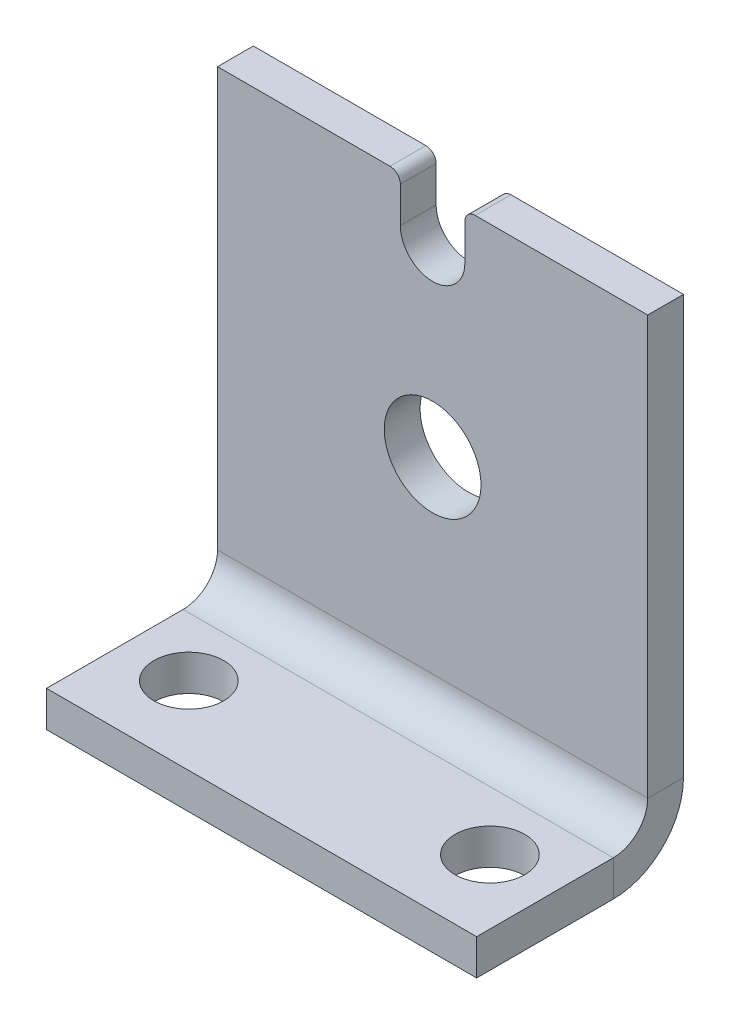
ISO-10303-21;
HEADER;
FILE_DESCRIPTION(('STEP AP214'),'2;1');
FILE_NAME('part.step','',(''),(''),'','','');
FILE_SCHEMA(('AUTOMOTIVE_DESIGN { 1 0 10303 214 1 1 1 1 }'));
ENDSEC;
DATA;
#1=APPLICATION_CONTEXT('core data for automotive mechanical design processes');
#2=APPLICATION_PROTOCOL_DEFINITION('international standard','automotive_design',2000,#1);
#3=PRODUCT_CONTEXT('',#1,'mechanical');
#4=PRODUCT('Part','Part','',(#3));
#5=PRODUCT_RELATED_PRODUCT_CATEGORY('part','',(#4));
#6=PRODUCT_DEFINITION_FORMATION('','',#4);
#7=PRODUCT_DEFINITION_CONTEXT('part definition',#1,'design');
#8=PRODUCT_DEFINITION('design','',#6,#7);
#9=PRODUCT_DEFINITION_SHAPE('','',#8);
#10=(LENGTH_UNIT() NAMED_UNIT(*) SI_UNIT(.MILLI.,.METRE.));
#11=(NAMED_UNIT(*) PLANE_ANGLE_UNIT() SI_UNIT($,.RADIAN.));
#12=(NAMED_UNIT(*) SI_UNIT($,.STERADIAN.) SOLID_ANGLE_UNIT());
#13=UNCERTAINTY_MEASURE_WITH_UNIT(LENGTH_MEASURE(1.E-05),#10,'distance_accuracy_value','');
#14=(GEOMETRIC_REPRESENTATION_CONTEXT(3) GLOBAL_UNCERTAINTY_ASSIGNED_CONTEXT((#13)) GLOBAL_UNIT_ASSIGNED_CONTEXT((#10,
#11,#12)) REPRESENTATION_CONTEXT('',''));
#15=CARTESIAN_POINT('',(0.,0.,0.));
#16=DIRECTION('',(0.,0.,1.));
#17=DIRECTION('',(1.,0.,0.));
#18=AXIS2_PLACEMENT_3D('',#15,#16,#17);
#19=CARTESIAN_POINT('',(-15.875,18.034,-2.6416));
#20=DIRECTION('',(0.,1.,0.));
#21=DIRECTION('',(0.,0.,1.));
#22=AXIS2_PLACEMENT_3D('',#19,#20,#21);
#23=PLANE('',#22);
#24=DIRECTION('',(-1.,0.,0.));
#25=VECTOR('',#24,1.);
#26=CARTESIAN_POINT('',(-15.875,18.034,0.));
#27=LINE('',#26,#25);
#28=CARTESIAN_POINT('',(-3.14325,18.034,0.));
#29=VERTEX_POINT('',#28);
#30=CARTESIAN_POINT('',(-15.875,18.034,0.));
#31=VERTEX_POINT('',#30);
#32=EDGE_CURVE('E273',#29,#31,#27,.T.);
#33=ORIENTED_EDGE('',*,*,#32,.F.);
#34=DIRECTION('',(0.,0.,1.));
#35=VECTOR('',#34,1.);
#36=CARTESIAN_POINT('',(-3.14325,18.034,-2.6416));
#37=LINE('',#36,#35);
#38=CARTESIAN_POINT('',(-3.14325,18.034,-2.6416));
#39=VERTEX_POINT('',#38);
#40=EDGE_CURVE('E289',#29,#39,#37,.F.);
#41=ORIENTED_EDGE('',*,*,#40,.T.);
#42=DIRECTION('',(-1.,0.,0.));
#43=VECTOR('',#42,1.);
#44=CARTESIAN_POINT('',(-15.875,18.034,-2.6416));
#45=LINE('',#44,#43);
#46=CARTESIAN_POINT('',(-15.875,18.034,-2.6416));
#47=VERTEX_POINT('',#46);
#48=EDGE_CURVE('E264',#39,#47,#45,.T.);
#49=ORIENTED_EDGE('',*,*,#48,.T.);
#50=DIRECTION('',(0.,0.,1.));
#51=VECTOR('',#50,1.);
#52=CARTESIAN_POINT('',(-15.875,18.034,-2.6416));
#53=LINE('',#52,#51);
#54=EDGE_CURVE('E278',#47,#31,#53,.T.);
#55=ORIENTED_EDGE('',*,*,#54,.T.);
#56=EDGE_LOOP('',(#33,#41,#49,#55));
#57=FACE_BOUND('',#56,.T.);
#58=ADVANCED_FACE('F56',(#57),#23,.T.);
#59=CARTESIAN_POINT('',(15.875,-18.034,-2.6416));
#60=DIRECTION('',(1.,0.,0.));
#61=DIRECTION('',(0.,0.,-1.));
#62=AXIS2_PLACEMENT_3D('',#59,#60,#61);
#63=PLANE('',#62);
#64=DIRECTION('',(0.,1.,0.));
#65=VECTOR('',#64,1.);
#66=CARTESIAN_POINT('',(15.875,-18.034,0.));
#67=LINE('',#66,#65);
#68=CARTESIAN_POINT('',(15.875,-12.8524,0.));
#69=VERTEX_POINT('',#68);
#70=CARTESIAN_POINT('',(15.875,18.034,0.));
#71=VERTEX_POINT('',#70);
#72=EDGE_CURVE('E259',#69,#71,#67,.T.);
#73=ORIENTED_EDGE('',*,*,#72,.F.);
#74=DIRECTION('',(0.,0.,-1.));
#75=VECTOR('',#74,1.);
#76=CARTESIAN_POINT('',(15.875,-12.8524,0.));
#77=LINE('',#76,#75);
#78=CARTESIAN_POINT('',(15.875,-12.8524,-2.6416));
#79=VERTEX_POINT('',#78);
#80=EDGE_CURVE('E246',#69,#79,#77,.T.);
#81=ORIENTED_EDGE('',*,*,#80,.T.);
#82=DIRECTION('',(0.,1.,0.));
#83=VECTOR('',#82,1.);
#84=CARTESIAN_POINT('',(15.875,-18.034,-2.6416));
#85=LINE('',#84,#83);
#86=CARTESIAN_POINT('',(15.875,18.034,-2.6416));
#87=VERTEX_POINT('',#86);
#88=EDGE_CURVE('E262',#79,#87,#85,.T.);
#89=ORIENTED_EDGE('',*,*,#88,.T.);
#90=DIRECTION('',(0.,0.,1.));
#91=VECTOR('',#90,1.);
#92=CARTESIAN_POINT('',(15.875,18.034,-2.6416));
#93=LINE('',#92,#91);
#94=EDGE_CURVE('E271',#87,#71,#93,.T.);
#95=ORIENTED_EDGE('',*,*,#94,.T.);
#96=EDGE_LOOP('',(#73,#81,#89,#95));
#97=FACE_BOUND('',#96,.T.);
#98=ADVANCED_FACE('F317',(#97),#63,.T.);
#99=CARTESIAN_POINT('',(0.,0.,-2.6416));
#100=DIRECTION('',(0.,0.,-1.));
#101=DIRECTION('',(-1.,0.,0.));
#102=AXIS2_PLACEMENT_3D('',#99,#100,#101);
#103=PLANE('',#102);
#104=ORIENTED_EDGE('',*,*,#48,.F.);
#105=CARTESIAN_POINT('',(-3.14325,17.272,-2.6416));
#106=DIRECTION('',(0.,0.,-1.));
#107=DIRECTION('',(-1.,0.,0.));
#108=AXIS2_PLACEMENT_3D('',#105,#106,#107);
#109=CIRCLE('',#108,0.762);
#110=CARTESIAN_POINT('',(-2.38125,17.272,-2.6416));
#111=VERTEX_POINT('',#110);
#112=EDGE_CURVE('E292',#39,#111,#109,.T.);
#113=ORIENTED_EDGE('',*,*,#112,.T.);
#114=DIRECTION('',(0.,1.,0.));
#115=VECTOR('',#114,1.);
#116=CARTESIAN_POINT('',(-2.38125,20.4917479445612,-2.6416));
#117=LINE('',#116,#115);
#118=CARTESIAN_POINT('',(-2.38125,14.62405,-2.6416));
#119=VERTEX_POINT('',#118);
#120=EDGE_CURVE('E167',#119,#111,#117,.T.);
#121=ORIENTED_EDGE('',*,*,#120,.F.);
#122=CARTESIAN_POINT('',(0.,14.62405,-2.6416));
#123=DIRECTION('',(0.,0.,-1.));
#124=DIRECTION('',(-1.,0.,0.));
#125=AXIS2_PLACEMENT_3D('',#122,#123,#124);
#126=CIRCLE('',#125,2.38125);
#127=CARTESIAN_POINT('',(2.38125,14.62405,-2.6416));
#128=VERTEX_POINT('',#127);
#129=EDGE_CURVE('E185',#128,#119,#126,.T.);
#130=ORIENTED_EDGE('',*,*,#129,.F.);
#131=DIRECTION('',(0.,-1.,0.));
#132=VECTOR('',#131,1.);
#133=CARTESIAN_POINT('',(2.38125,20.4917479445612,-2.6416));
#134=LINE('',#133,#132);
#135=CARTESIAN_POINT('',(2.38125,17.272,-2.6416));
#136=VERTEX_POINT('',#135);
#137=EDGE_CURVE('E172',#136,#128,#134,.T.);
#138=ORIENTED_EDGE('',*,*,#137,.F.);
#139=CARTESIAN_POINT('',(3.14325,17.272,-2.6416));
#140=DIRECTION('',(0.,0.,-1.));
#141=DIRECTION('',(-1.,0.,0.));
#142=AXIS2_PLACEMENT_3D('',#139,#140,#141);
#143=CIRCLE('',#142,0.762);
#144=CARTESIAN_POINT('',(3.14325,18.034,-2.6416));
#145=VERTEX_POINT('',#144);
#146=EDGE_CURVE('E71',#136,#145,#143,.T.);
#147=ORIENTED_EDGE('',*,*,#146,.T.);
#148=EDGE_CURVE('E266',#87,#145,#45,.T.);
#149=ORIENTED_EDGE('',*,*,#148,.F.);
#150=ORIENTED_EDGE('',*,*,#88,.F.);
#151=DIRECTION('',(1.,0.,0.));
#152=VECTOR('',#151,1.);
#153=CARTESIAN_POINT('',(15.875,-12.8524,-2.6416));
#154=LINE('',#153,#152);
#155=CARTESIAN_POINT('',(-15.875,-12.8524,-2.6416));
#156=VERTEX_POINT('',#155);
#157=EDGE_CURVE('E239',#79,#156,#154,.F.);
#158=ORIENTED_EDGE('',*,*,#157,.T.);
#159=DIRECTION('',(0.,-1.,0.));
#160=VECTOR('',#159,1.);
#161=CARTESIAN_POINT('',(-15.875,-18.034,-2.6416));
#162=LINE('',#161,#160);
#163=EDGE_CURVE('E268',#47,#156,#162,.T.);
#164=ORIENTED_EDGE('',*,*,#163,.F.);
#165=EDGE_LOOP('',(#104,#113,#121,#130,#138,#147,#149,#150,#158,#164));
#166=FACE_BOUND('',#165,.T.);
#167=CARTESIAN_POINT('',(0.,1.01599999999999,-2.6416));
#168=DIRECTION('',(0.,0.,-1.));
#169=DIRECTION('',(-1.,0.,0.));
#170=AXIS2_PLACEMENT_3D('',#167,#168,#169);
#171=CIRCLE('',#170,3.5687);
#172=CARTESIAN_POINT('',(-3.5687,1.01599999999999,-2.6416));
#173=VERTEX_POINT('',#172);
#174=EDGE_CURVE('E189',#173,#173,#171,.T.);
#175=ORIENTED_EDGE('',*,*,#174,.F.);
#176=EDGE_LOOP('',(#175));
#177=FACE_BOUND('',#176,.T.);
#178=ADVANCED_FACE('F294',(#166,#177),#103,.T.);
#179=CARTESIAN_POINT('',(0.,0.,0.));
#180=DIRECTION('',(0.,0.,-1.));
#181=DIRECTION('',(-1.,0.,0.));
#182=AXIS2_PLACEMENT_3D('',#179,#180,#181);
#183=PLANE('',#182);
#184=CARTESIAN_POINT('',(0.,1.01599999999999,0.));
#185=DIRECTION('',(0.,0.,-1.));
#186=DIRECTION('',(-1.,0.,0.));
#187=AXIS2_PLACEMENT_3D('',#184,#185,#186);
#188=CIRCLE('',#187,3.5687);
#189=CARTESIAN_POINT('',(-3.5687,1.01599999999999,0.));
#190=VERTEX_POINT('',#189);
#191=EDGE_CURVE('E191',#190,#190,#188,.T.);
#192=ORIENTED_EDGE('',*,*,#191,.T.);
#193=EDGE_LOOP('',(#192));
#194=FACE_BOUND('',#193,.T.);
#195=DIRECTION('',(0.,1.,0.));
#196=VECTOR('',#195,1.);
#197=CARTESIAN_POINT('',(-2.38125,20.4917479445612,0.));
#198=LINE('',#197,#196);
#199=CARTESIAN_POINT('',(-2.38125,14.62405,0.));
#200=VERTEX_POINT('',#199);
#201=CARTESIAN_POINT('',(-2.38125,17.272,0.));
#202=VERTEX_POINT('',#201);
#203=EDGE_CURVE('E177',#200,#202,#198,.T.);
#204=ORIENTED_EDGE('',*,*,#203,.T.);
#205=CARTESIAN_POINT('',(-3.14325,17.272,0.));
#206=DIRECTION('',(0.,0.,-1.));
#207=DIRECTION('',(-1.,0.,0.));
#208=AXIS2_PLACEMENT_3D('',#205,#206,#207);
#209=CIRCLE('',#208,0.762);
#210=EDGE_CURVE('E287',#202,#29,#209,.F.);
#211=ORIENTED_EDGE('',*,*,#210,.T.);
#212=ORIENTED_EDGE('',*,*,#32,.T.);
#213=DIRECTION('',(0.,-1.,0.));
#214=VECTOR('',#213,1.);
#215=CARTESIAN_POINT('',(-15.875,-18.034,0.));
#216=LINE('',#215,#214);
#217=CARTESIAN_POINT('',(-15.875,-12.8524,0.));
#218=VERTEX_POINT('',#217);
#219=EDGE_CURVE('E265',#31,#218,#216,.T.);
#220=ORIENTED_EDGE('',*,*,#219,.T.);
#221=DIRECTION('',(1.,0.,0.));
#222=VECTOR('',#221,1.);
#223=CARTESIAN_POINT('',(15.875,-12.8524,0.));
#224=LINE('',#223,#222);
#225=EDGE_CURVE('E252',#69,#218,#224,.F.);
#226=ORIENTED_EDGE('',*,*,#225,.F.);
#227=ORIENTED_EDGE('',*,*,#72,.T.);
#228=CARTESIAN_POINT('',(3.14325,18.034,0.));
#229=VERTEX_POINT('',#228);
#230=EDGE_CURVE('E274',#71,#229,#27,.T.);
#231=ORIENTED_EDGE('',*,*,#230,.T.);
#232=CARTESIAN_POINT('',(3.14325,17.272,0.));
#233=DIRECTION('',(0.,0.,-1.));
#234=DIRECTION('',(-1.,0.,0.));
#235=AXIS2_PLACEMENT_3D('',#232,#233,#234);
#236=CIRCLE('',#235,0.762);
#237=CARTESIAN_POINT('',(2.38125,17.272,0.));
#238=VERTEX_POINT('',#237);
#239=EDGE_CURVE('E165',#229,#238,#236,.F.);
#240=ORIENTED_EDGE('',*,*,#239,.T.);
#241=DIRECTION('',(0.,-1.,0.));
#242=VECTOR('',#241,1.);
#243=CARTESIAN_POINT('',(2.38125,20.4917479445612,0.));
#244=LINE('',#243,#242);
#245=CARTESIAN_POINT('',(2.38125,14.62405,0.));
#246=VERTEX_POINT('',#245);
#247=EDGE_CURVE('E157',#238,#246,#244,.T.);
#248=ORIENTED_EDGE('',*,*,#247,.T.);
#249=CARTESIAN_POINT('',(0.,14.62405,0.));
#250=DIRECTION('',(0.,0.,-1.));
#251=DIRECTION('',(-1.,0.,0.));
#252=AXIS2_PLACEMENT_3D('',#249,#250,#251);
#253=CIRCLE('',#252,2.38125);
#254=EDGE_CURVE('E162',#246,#200,#253,.T.);
#255=ORIENTED_EDGE('',*,*,#254,.T.);
#256=EDGE_LOOP('',(#204,#211,#212,#220,#226,#227,#231,#240,#248,#255));
#257=FACE_BOUND('',#256,.T.);
#258=ADVANCED_FACE('F160',(#194,#257),#183,.F.);
#259=CARTESIAN_POINT('',(-15.875,-18.034,-2.6416));
#260=DIRECTION('',(-1.,0.,0.));
#261=DIRECTION('',(0.,0.,1.));
#262=AXIS2_PLACEMENT_3D('',#259,#260,#261);
#263=PLANE('',#262);
#264=DIRECTION('',(0.,0.,-1.));
#265=VECTOR('',#264,1.);
#266=CARTESIAN_POINT('',(-15.875,-12.8524,0.));
#267=LINE('',#266,#265);
#268=EDGE_CURVE('E256',#218,#156,#267,.T.);
#269=ORIENTED_EDGE('',*,*,#268,.F.);
#270=ORIENTED_EDGE('',*,*,#219,.F.);
#271=ORIENTED_EDGE('',*,*,#54,.F.);
#272=ORIENTED_EDGE('',*,*,#163,.T.);
#273=EDGE_LOOP('',(#269,#270,#271,#272));
#274=FACE_BOUND('',#273,.T.);
#275=ADVANCED_FACE('F311',(#274),#263,.T.);
#276=ORIENTED_EDGE('',*,*,#148,.T.);
#277=DIRECTION('',(0.,0.,-1.));
#278=VECTOR('',#277,1.);
#279=CARTESIAN_POINT('',(3.14325,18.034,0.));
#280=LINE('',#279,#278);
#281=EDGE_CURVE('E13',#145,#229,#280,.F.);
#282=ORIENTED_EDGE('',*,*,#281,.T.);
#283=ORIENTED_EDGE('',*,*,#230,.F.);
#284=ORIENTED_EDGE('',*,*,#94,.F.);
#285=EDGE_LOOP('',(#276,#282,#283,#284));
#286=FACE_BOUND('',#285,.T.);
#287=ADVANCED_FACE('F322',(#286),#23,.T.);
#288=CARTESIAN_POINT('',(-15.875,-12.8524,2.54));
#289=DIRECTION('',(-1.,0.,0.));
#290=DIRECTION('',(0.,0.,1.));
#291=AXIS2_PLACEMENT_3D('',#288,#289,#290);
#292=PLANE('',#291);
#293=DIRECTION('',(0.,1.,0.));
#294=VECTOR('',#293,1.);
#295=CARTESIAN_POINT('',(-15.875,-18.034,2.53999999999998));
#296=LINE('',#295,#294);
#297=CARTESIAN_POINT('',(-15.875,-15.3924,2.53999999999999));
#298=VERTEX_POINT('',#297);
#299=CARTESIAN_POINT('',(-15.875,-18.034,2.53999999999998));
#300=VERTEX_POINT('',#299);
#301=EDGE_CURVE('E206',#298,#300,#296,.F.);
#302=ORIENTED_EDGE('',*,*,#301,.F.);
#303=CARTESIAN_POINT('',(-15.875,-12.8524,2.54));
#304=DIRECTION('',(1.,0.,0.));
#305=DIRECTION('',(0.,0.,-1.));
#306=AXIS2_PLACEMENT_3D('',#303,#304,#305);
#307=CIRCLE('',#306,2.54);
#308=EDGE_CURVE('E249',#218,#298,#307,.F.);
#309=ORIENTED_EDGE('',*,*,#308,.F.);
#310=ORIENTED_EDGE('',*,*,#268,.T.);
#311=CARTESIAN_POINT('',(-15.875,-12.8524,2.54));
#312=DIRECTION('',(1.,0.,0.));
#313=DIRECTION('',(0.,0.,-1.));
#314=AXIS2_PLACEMENT_3D('',#311,#312,#313);
#315=CIRCLE('',#314,5.1816);
#316=EDGE_CURVE('E242',#156,#300,#315,.F.);
#317=ORIENTED_EDGE('',*,*,#316,.T.);
#318=EDGE_LOOP('',(#302,#309,#310,#317));
#319=FACE_BOUND('',#318,.T.);
#320=ADVANCED_FACE('F335',(#319),#292,.T.);
#321=CARTESIAN_POINT('',(15.875,-12.8524,2.54));
#322=DIRECTION('',(-1.,0.,0.));
#323=DIRECTION('',(0.,0.,1.));
#324=AXIS2_PLACEMENT_3D('',#321,#322,#323);
#325=PLANE('',#324);
#326=CARTESIAN_POINT('',(15.875,-12.8524,2.54));
#327=DIRECTION('',(1.,0.,0.));
#328=DIRECTION('',(0.,0.,-1.));
#329=AXIS2_PLACEMENT_3D('',#326,#327,#328);
#330=CIRCLE('',#329,2.54);
#331=CARTESIAN_POINT('',(15.875,-15.3924,2.53999999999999));
#332=VERTEX_POINT('',#331);
#333=EDGE_CURVE('E212',#332,#69,#330,.T.);
#334=ORIENTED_EDGE('',*,*,#333,.F.);
#335=DIRECTION('',(0.,1.,0.));
#336=VECTOR('',#335,1.);
#337=CARTESIAN_POINT('',(15.875,-15.3924,2.53999999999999));
#338=LINE('',#337,#336);
#339=CARTESIAN_POINT('',(15.875,-18.034,2.53999999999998));
#340=VERTEX_POINT('',#339);
#341=EDGE_CURVE('E232',#332,#340,#338,.F.);
#342=ORIENTED_EDGE('',*,*,#341,.T.);
#343=CARTESIAN_POINT('',(15.875,-12.8524,2.54));
#344=DIRECTION('',(1.,0.,0.));
#345=DIRECTION('',(0.,0.,-1.));
#346=AXIS2_PLACEMENT_3D('',#343,#344,#345);
#347=CIRCLE('',#346,5.1816);
#348=EDGE_CURVE('E243',#340,#79,#347,.T.);
#349=ORIENTED_EDGE('',*,*,#348,.T.);
#350=ORIENTED_EDGE('',*,*,#80,.F.);
#351=EDGE_LOOP('',(#334,#342,#349,#350));
#352=FACE_BOUND('',#351,.T.);
#353=ADVANCED_FACE('F340',(#352),#325,.F.);
#354=CARTESIAN_POINT('',(15.875,-12.8524,2.54));
#355=DIRECTION('',(1.,0.,0.));
#356=DIRECTION('',(0.,-1.,0.));
#357=AXIS2_PLACEMENT_3D('',#354,#355,#356);
#358=CYLINDRICAL_SURFACE('',#357,5.1816);
#359=ORIENTED_EDGE('',*,*,#157,.F.);
#360=ORIENTED_EDGE('',*,*,#348,.F.);
#361=DIRECTION('',(1.,0.,0.));
#362=VECTOR('',#361,1.);
#363=CARTESIAN_POINT('',(-15.875,-18.034,2.53999999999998));
#364=LINE('',#363,#362);
#365=EDGE_CURVE('E230',#340,#300,#364,.F.);
#366=ORIENTED_EDGE('',*,*,#365,.T.);
#367=ORIENTED_EDGE('',*,*,#316,.F.);
#368=EDGE_LOOP('',(#359,#360,#366,#367));
#369=FACE_BOUND('',#368,.T.);
#370=ADVANCED_FACE('F352',(#369),#358,.T.);
#371=CARTESIAN_POINT('',(15.875,-12.8524,2.54));
#372=DIRECTION('',(1.,0.,0.));
#373=DIRECTION('',(0.,-1.,0.));
#374=AXIS2_PLACEMENT_3D('',#371,#372,#373);
#375=CYLINDRICAL_SURFACE('',#374,2.54);
#376=ORIENTED_EDGE('',*,*,#225,.T.);
#377=ORIENTED_EDGE('',*,*,#308,.T.);
#378=DIRECTION('',(1.,0.,0.));
#379=VECTOR('',#378,1.);
#380=CARTESIAN_POINT('',(-15.875,-15.3924,2.53999999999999));
#381=LINE('',#380,#379);
#382=EDGE_CURVE('E235',#298,#332,#381,.T.);
#383=ORIENTED_EDGE('',*,*,#382,.T.);
#384=ORIENTED_EDGE('',*,*,#333,.T.);
#385=EDGE_LOOP('',(#376,#377,#383,#384));
#386=FACE_BOUND('',#385,.T.);
#387=ADVANCED_FACE('F355',(#386),#375,.F.);
#388=CARTESIAN_POINT('',(15.875,-18.034,12.6238));
#389=DIRECTION('',(-1.,0.,0.));
#390=DIRECTION('',(0.,0.,1.));
#391=AXIS2_PLACEMENT_3D('',#388,#389,#390);
#392=PLANE('',#391);
#393=ORIENTED_EDGE('',*,*,#341,.F.);
#394=DIRECTION('',(0.,0.,-1.));
#395=VECTOR('',#394,1.);
#396=CARTESIAN_POINT('',(15.875,-15.3924,12.6238));
#397=LINE('',#396,#395);
#398=CARTESIAN_POINT('',(15.875,-15.3924,12.6238));
#399=VERTEX_POINT('',#398);
#400=EDGE_CURVE('E228',#332,#399,#397,.F.);
#401=ORIENTED_EDGE('',*,*,#400,.T.);
#402=DIRECTION('',(0.,1.,0.));
#403=VECTOR('',#402,1.);
#404=CARTESIAN_POINT('',(15.875,-18.034,12.6238));
#405=LINE('',#404,#403);
#406=CARTESIAN_POINT('',(15.875,-18.034,12.6238));
#407=VERTEX_POINT('',#406);
#408=EDGE_CURVE('E209',#407,#399,#405,.T.);
#409=ORIENTED_EDGE('',*,*,#408,.F.);
#410=DIRECTION('',(0.,0.,1.));
#411=VECTOR('',#410,1.);
#412=CARTESIAN_POINT('',(15.875,-18.034,0.));
#413=LINE('',#412,#411);
#414=EDGE_CURVE('E221',#340,#407,#413,.T.);
#415=ORIENTED_EDGE('',*,*,#414,.F.);
#416=EDGE_LOOP('',(#393,#401,#409,#415));
#417=FACE_BOUND('',#416,.T.);
#418=ADVANCED_FACE('F358',(#417),#392,.F.);
#419=CARTESIAN_POINT('',(-15.875,-18.034,0.));
#420=DIRECTION('',(1.,0.,0.));
#421=DIRECTION('',(0.,0.,-1.));
#422=AXIS2_PLACEMENT_3D('',#419,#420,#421);
#423=PLANE('',#422);
#424=ORIENTED_EDGE('',*,*,#301,.T.);
#425=DIRECTION('',(0.,0.,-1.));
#426=VECTOR('',#425,1.);
#427=CARTESIAN_POINT('',(-15.875,-18.034,0.));
#428=LINE('',#427,#426);
#429=CARTESIAN_POINT('',(-15.875,-18.034,12.6238));
#430=VERTEX_POINT('',#429);
#431=EDGE_CURVE('E216',#430,#300,#428,.T.);
#432=ORIENTED_EDGE('',*,*,#431,.F.);
#433=DIRECTION('',(0.,1.,0.));
#434=VECTOR('',#433,1.);
#435=CARTESIAN_POINT('',(-15.875,-18.034,12.6238));
#436=LINE('',#435,#434);
#437=CARTESIAN_POINT('',(-15.875,-15.3924,12.6238));
#438=VERTEX_POINT('',#437);
#439=EDGE_CURVE('E213',#430,#438,#436,.T.);
#440=ORIENTED_EDGE('',*,*,#439,.T.);
#441=DIRECTION('',(0.,0.,1.));
#442=VECTOR('',#441,1.);
#443=CARTESIAN_POINT('',(-15.875,-15.3924,0.));
#444=LINE('',#443,#442);
#445=EDGE_CURVE('E223',#438,#298,#444,.F.);
#446=ORIENTED_EDGE('',*,*,#445,.T.);
#447=EDGE_LOOP('',(#424,#432,#440,#446));
#448=FACE_BOUND('',#447,.T.);
#449=ADVANCED_FACE('F364',(#448),#423,.F.);
#450=CARTESIAN_POINT('',(0.,-18.034,0.));
#451=DIRECTION('',(0.,1.,0.));
#452=DIRECTION('',(0.,0.,1.));
#453=AXIS2_PLACEMENT_3D('',#450,#451,#452);
#454=PLANE('',#453);
#455=CARTESIAN_POINT('',(-11.1125,-18.034,6.88339999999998));
#456=DIRECTION('',(0.,-1.,0.));
#457=DIRECTION('',(0.,0.,-1.));
#458=AXIS2_PLACEMENT_3D('',#455,#456,#457);
#459=CIRCLE('',#458,2.5781);
#460=CARTESIAN_POINT('',(-11.1125,-18.034,4.30529999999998));
#461=VERTEX_POINT('',#460);
#462=EDGE_CURVE('E194',#461,#461,#459,.T.);
#463=ORIENTED_EDGE('',*,*,#462,.F.);
#464=EDGE_LOOP('',(#463));
#465=FACE_BOUND('',#464,.T.);
#466=CARTESIAN_POINT('',(11.1125,-18.034,6.88339999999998));
#467=DIRECTION('',(0.,-1.,0.));
#468=DIRECTION('',(0.,0.,-1.));
#469=AXIS2_PLACEMENT_3D('',#466,#467,#468);
#470=CIRCLE('',#469,2.5781);
#471=CARTESIAN_POINT('',(11.1125,-18.034,4.30529999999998));
#472=VERTEX_POINT('',#471);
#473=EDGE_CURVE('E200',#472,#472,#470,.T.);
#474=ORIENTED_EDGE('',*,*,#473,.F.);
#475=EDGE_LOOP('',(#474));
#476=FACE_BOUND('',#475,.T.);
#477=ORIENTED_EDGE('',*,*,#365,.F.);
#478=ORIENTED_EDGE('',*,*,#414,.T.);
#479=DIRECTION('',(-1.,0.,0.));
#480=VECTOR('',#479,1.);
#481=CARTESIAN_POINT('',(0.,-18.034,12.6238));
#482=LINE('',#481,#480);
#483=EDGE_CURVE('E219',#407,#430,#482,.T.);
#484=ORIENTED_EDGE('',*,*,#483,.T.);
#485=ORIENTED_EDGE('',*,*,#431,.T.);
#486=EDGE_LOOP('',(#477,#478,#484,#485));
#487=FACE_BOUND('',#486,.T.);
#488=ADVANCED_FACE('F374',(#465,#476,#487),#454,.F.);
#489=CARTESIAN_POINT('',(0.,-15.3924,0.));
#490=DIRECTION('',(0.,1.,0.));
#491=DIRECTION('',(0.,0.,1.));
#492=AXIS2_PLACEMENT_3D('',#489,#490,#491);
#493=PLANE('',#492);
#494=CARTESIAN_POINT('',(-11.1125,-15.3924,6.88339999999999));
#495=DIRECTION('',(0.,-1.,0.));
#496=DIRECTION('',(0.,0.,-1.));
#497=AXIS2_PLACEMENT_3D('',#494,#495,#496);
#498=CIRCLE('',#497,2.5781);
#499=CARTESIAN_POINT('',(-11.1125,-15.3924,4.30529999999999));
#500=VERTEX_POINT('',#499);
#501=EDGE_CURVE('E197',#500,#500,#498,.T.);
#502=ORIENTED_EDGE('',*,*,#501,.T.);
#503=EDGE_LOOP('',(#502));
#504=FACE_BOUND('',#503,.T.);
#505=CARTESIAN_POINT('',(11.1125,-15.3924,6.88339999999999));
#506=DIRECTION('',(0.,-1.,0.));
#507=DIRECTION('',(0.,0.,-1.));
#508=AXIS2_PLACEMENT_3D('',#505,#506,#507);
#509=CIRCLE('',#508,2.5781);
#510=CARTESIAN_POINT('',(11.1125,-15.3924,4.30529999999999));
#511=VERTEX_POINT('',#510);
#512=EDGE_CURVE('E203',#511,#511,#509,.T.);
#513=ORIENTED_EDGE('',*,*,#512,.T.);
#514=EDGE_LOOP('',(#513));
#515=FACE_BOUND('',#514,.T.);
#516=ORIENTED_EDGE('',*,*,#400,.F.);
#517=ORIENTED_EDGE('',*,*,#382,.F.);
#518=ORIENTED_EDGE('',*,*,#445,.F.);
#519=DIRECTION('',(1.,0.,0.));
#520=VECTOR('',#519,1.);
#521=CARTESIAN_POINT('',(-15.875,-15.3924,12.6238));
#522=LINE('',#521,#520);
#523=EDGE_CURVE('E226',#399,#438,#522,.F.);
#524=ORIENTED_EDGE('',*,*,#523,.F.);
#525=EDGE_LOOP('',(#516,#517,#518,#524));
#526=FACE_BOUND('',#525,.T.);
#527=ADVANCED_FACE('F370',(#504,#515,#526),#493,.T.);
#528=CARTESIAN_POINT('',(-15.875,-18.034,12.6238));
#529=DIRECTION('',(0.,0.,-1.));
#530=DIRECTION('',(0.,1.,0.));
#531=AXIS2_PLACEMENT_3D('',#528,#529,#530);
#532=PLANE('',#531);
#533=ORIENTED_EDGE('',*,*,#523,.T.);
#534=ORIENTED_EDGE('',*,*,#439,.F.);
#535=ORIENTED_EDGE('',*,*,#483,.F.);
#536=ORIENTED_EDGE('',*,*,#408,.T.);
#537=EDGE_LOOP('',(#533,#534,#535,#536));
#538=FACE_BOUND('',#537,.T.);
#539=ADVANCED_FACE('F366',(#538),#532,.F.);
#540=CARTESIAN_POINT('',(11.1125,-15.3924,6.88339999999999));
#541=DIRECTION('',(0.,-1.,0.));
#542=DIRECTION('',(0.,0.,-1.));
#543=AXIS2_PLACEMENT_3D('',#540,#541,#542);
#544=CYLINDRICAL_SURFACE('',#543,2.5781);
#545=ORIENTED_EDGE('',*,*,#512,.F.);
#546=EDGE_LOOP('',(#545));
#547=FACE_BOUND('',#546,.T.);
#548=ORIENTED_EDGE('',*,*,#473,.T.);
#549=EDGE_LOOP('',(#548));
#550=FACE_BOUND('',#549,.T.);
#551=ADVANCED_FACE('F369',(#547,#550),#544,.F.);
#552=CARTESIAN_POINT('',(-11.1125,-15.3924,6.88339999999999));
#553=DIRECTION('',(0.,-1.,0.));
#554=DIRECTION('',(0.,0.,-1.));
#555=AXIS2_PLACEMENT_3D('',#552,#553,#554);
#556=CYLINDRICAL_SURFACE('',#555,2.5781);
#557=ORIENTED_EDGE('',*,*,#501,.F.);
#558=EDGE_LOOP('',(#557));
#559=FACE_BOUND('',#558,.T.);
#560=ORIENTED_EDGE('',*,*,#462,.T.);
#561=EDGE_LOOP('',(#560));
#562=FACE_BOUND('',#561,.T.);
#563=ADVANCED_FACE('F384',(#559,#562),#556,.F.);
#564=CARTESIAN_POINT('',(0.,1.01599999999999,0.));
#565=DIRECTION('',(0.,0.,-1.));
#566=DIRECTION('',(-1.,0.,0.));
#567=AXIS2_PLACEMENT_3D('',#564,#565,#566);
#568=CYLINDRICAL_SURFACE('',#567,3.5687);
#569=ORIENTED_EDGE('',*,*,#191,.F.);
#570=EDGE_LOOP('',(#569));
#571=FACE_BOUND('',#570,.T.);
#572=ORIENTED_EDGE('',*,*,#174,.T.);
#573=EDGE_LOOP('',(#572));
#574=FACE_BOUND('',#573,.T.);
#575=ADVANCED_FACE('F388',(#571,#574),#568,.F.);
#576=CARTESIAN_POINT('',(-2.38125,20.4917479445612,0.));
#577=DIRECTION('',(-1.,0.,0.));
#578=DIRECTION('',(0.,-1.,0.));
#579=AXIS2_PLACEMENT_3D('',#576,#577,#578);
#580=PLANE('',#579);
#581=ORIENTED_EDGE('',*,*,#120,.T.);
#582=DIRECTION('',(0.,0.,1.));
#583=VECTOR('',#582,1.);
#584=CARTESIAN_POINT('',(-2.38125,17.272,0.));
#585=LINE('',#584,#583);
#586=EDGE_CURVE('E281',#111,#202,#585,.T.);
#587=ORIENTED_EDGE('',*,*,#586,.T.);
#588=ORIENTED_EDGE('',*,*,#203,.F.);
#589=DIRECTION('',(0.,0.,-1.));
#590=VECTOR('',#589,1.);
#591=CARTESIAN_POINT('',(-2.38125,14.62405,0.));
#592=LINE('',#591,#590);
#593=EDGE_CURVE('E176',#200,#119,#592,.T.);
#594=ORIENTED_EDGE('',*,*,#593,.T.);
#595=EDGE_LOOP('',(#581,#587,#588,#594));
#596=FACE_BOUND('',#595,.T.);
#597=ADVANCED_FACE('F300',(#596),#580,.F.);
#598=CARTESIAN_POINT('',(0.,14.62405,0.));
#599=DIRECTION('',(0.,0.,-1.));
#600=DIRECTION('',(-1.,0.,0.));
#601=AXIS2_PLACEMENT_3D('',#598,#599,#600);
#602=CYLINDRICAL_SURFACE('',#601,2.38125);
#603=ORIENTED_EDGE('',*,*,#129,.T.);
#604=ORIENTED_EDGE('',*,*,#593,.F.);
#605=ORIENTED_EDGE('',*,*,#254,.F.);
#606=DIRECTION('',(0.,0.,-1.));
#607=VECTOR('',#606,1.);
#608=CARTESIAN_POINT('',(2.38125,14.62405,0.));
#609=LINE('',#608,#607);
#610=EDGE_CURVE('E170',#246,#128,#609,.T.);
#611=ORIENTED_EDGE('',*,*,#610,.T.);
#612=EDGE_LOOP('',(#603,#604,#605,#611));
#613=FACE_BOUND('',#612,.T.);
#614=ADVANCED_FACE('F179',(#613),#602,.F.);
#615=CARTESIAN_POINT('',(2.38125,20.4917479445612,0.));
#616=DIRECTION('',(1.,0.,0.));
#617=DIRECTION('',(0.,0.,-1.));
#618=AXIS2_PLACEMENT_3D('',#615,#616,#617);
#619=PLANE('',#618);
#620=ORIENTED_EDGE('',*,*,#247,.F.);
#621=DIRECTION('',(0.,0.,-1.));
#622=VECTOR('',#621,1.);
#623=CARTESIAN_POINT('',(2.38125,17.272,-2.6416));
#624=LINE('',#623,#622);
#625=EDGE_CURVE('E64',#238,#136,#624,.T.);
#626=ORIENTED_EDGE('',*,*,#625,.T.);
#627=ORIENTED_EDGE('',*,*,#137,.T.);
#628=ORIENTED_EDGE('',*,*,#610,.F.);
#629=EDGE_LOOP('',(#620,#626,#627,#628));
#630=FACE_BOUND('',#629,.T.);
#631=ADVANCED_FACE('F171',(#630),#619,.F.);
#632=CARTESIAN_POINT('',(-3.14325,17.272,0.));
#633=DIRECTION('',(0.,0.,-1.));
#634=DIRECTION('',(-1.,0.,0.));
#635=AXIS2_PLACEMENT_3D('',#632,#633,#634);
#636=CYLINDRICAL_SURFACE('',#635,0.762);
#637=ORIENTED_EDGE('',*,*,#112,.F.);
#638=ORIENTED_EDGE('',*,*,#40,.F.);
#639=ORIENTED_EDGE('',*,*,#210,.F.);
#640=ORIENTED_EDGE('',*,*,#586,.F.);
#641=EDGE_LOOP('',(#637,#638,#639,#640));
#642=FACE_BOUND('',#641,.T.);
#643=ADVANCED_FACE('F302',(#642),#636,.T.);
#644=CARTESIAN_POINT('',(3.14325,17.272,0.));
#645=DIRECTION('',(0.,0.,1.));
#646=DIRECTION('',(1.,0.,0.));
#647=AXIS2_PLACEMENT_3D('',#644,#645,#646);
#648=CYLINDRICAL_SURFACE('',#647,0.762);
#649=ORIENTED_EDGE('',*,*,#239,.F.);
#650=ORIENTED_EDGE('',*,*,#281,.F.);
#651=ORIENTED_EDGE('',*,*,#146,.F.);
#652=ORIENTED_EDGE('',*,*,#625,.F.);
#653=EDGE_LOOP('',(#649,#650,#651,#652));
#654=FACE_BOUND('',#653,.T.);
#655=ADVANCED_FACE('F58',(#654),#648,.T.);
#656=CLOSED_SHELL('',(#58,#98,#178,#258,#275,#287,#320,#353,#370,#387,#418,#449,#488,#527,#539,
#551,#563,#575,#597,#614,#631,#643,#655));
#657=MANIFOLD_SOLID_BREP('B2',#656);
#658=ADVANCED_BREP_SHAPE_REPRESENTATION('',(#18,#657),#14);
#659=SHAPE_DEFINITION_REPRESENTATION(#9,#658);
ENDSEC;
END-ISO-10303-21;
